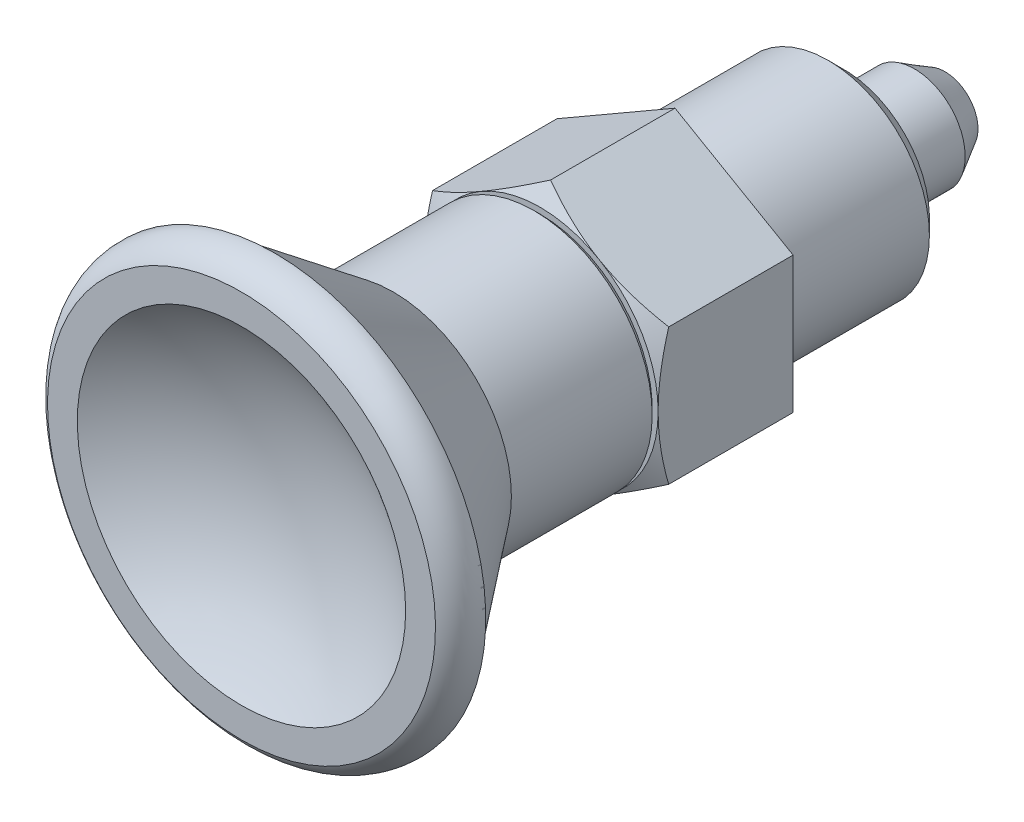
ISO-10303-21;
HEADER;
FILE_DESCRIPTION(('STEP AP214'),'2;1');
FILE_NAME('part.step','',(''),(''),'','','');
FILE_SCHEMA(('AUTOMOTIVE_DESIGN { 1 0 10303 214 1 1 1 1 }'));
ENDSEC;
DATA;
#1=APPLICATION_CONTEXT('core data for automotive mechanical design processes');
#2=APPLICATION_PROTOCOL_DEFINITION('international standard','automotive_design',2000,#1);
#3=PRODUCT_CONTEXT('',#1,'mechanical');
#4=PRODUCT('Part','Part','',(#3));
#5=PRODUCT_RELATED_PRODUCT_CATEGORY('part','',(#4));
#6=PRODUCT_DEFINITION_FORMATION('','',#4);
#7=PRODUCT_DEFINITION_CONTEXT('part definition',#1,'design');
#8=PRODUCT_DEFINITION('design','',#6,#7);
#9=PRODUCT_DEFINITION_SHAPE('','',#8);
#10=(LENGTH_UNIT() NAMED_UNIT(*) SI_UNIT(.MILLI.,.METRE.));
#11=(NAMED_UNIT(*) PLANE_ANGLE_UNIT() SI_UNIT($,.RADIAN.));
#12=(NAMED_UNIT(*) SI_UNIT($,.STERADIAN.) SOLID_ANGLE_UNIT());
#13=UNCERTAINTY_MEASURE_WITH_UNIT(LENGTH_MEASURE(1.E-05),#10,'distance_accuracy_value','');
#14=(GEOMETRIC_REPRESENTATION_CONTEXT(3) GLOBAL_UNCERTAINTY_ASSIGNED_CONTEXT((#13)) GLOBAL_UNIT_ASSIGNED_CONTEXT((#10,
#11,#12)) REPRESENTATION_CONTEXT('',''));
#15=CARTESIAN_POINT('',(0.,0.,0.));
#16=DIRECTION('',(0.,0.,1.));
#17=DIRECTION('',(1.,0.,0.));
#18=AXIS2_PLACEMENT_3D('',#15,#16,#17);
#19=CARTESIAN_POINT('',(0.,0.,6.8452994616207));
#20=DIRECTION('',(0.,0.,-1.));
#21=DIRECTION('',(0.,1.,0.));
#22=AXIS2_PLACEMENT_3D('',#19,#20,#21);
#23=CONICAL_SURFACE('',#22,9.,1.04719755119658);
#24=CARTESIAN_POINT('',(-7.0002,4.04133641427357,7.37471854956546));
#25=CARTESIAN_POINT('',(-6.84633209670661,4.13017208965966,7.42600015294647));
#26=CARTESIAN_POINT('',(-6.69189049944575,4.21933898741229,7.47495440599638));
#27=CARTESIAN_POINT('',(-6.38175307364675,4.39839691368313,7.56756721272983));
#28=CARTESIAN_POINT('',(-6.22605673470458,4.48828823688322,7.61122348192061));
#29=CARTESIAN_POINT('',(-5.75647483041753,4.75940147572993,7.73338840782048));
#30=CARTESIAN_POINT('',(-5.44073566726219,4.94169356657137,7.80287444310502));
#31=CARTESIAN_POINT('',(-4.96823775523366,5.21449036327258,7.88435504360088));
#32=CARTESIAN_POINT('',(-4.8128907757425,5.3041799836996,7.90756651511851));
#33=CARTESIAN_POINT('',(-4.50149488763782,5.48396448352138,7.94648878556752));
#34=CARTESIAN_POINT('',(-4.34544604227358,5.57405932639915,7.96220024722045));
#35=CARTESIAN_POINT('',(-4.03307732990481,5.75440548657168,7.98572208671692));
#36=CARTESIAN_POINT('',(-3.87675797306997,5.84465650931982,7.99354143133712));
#37=CARTESIAN_POINT('',(-3.5639834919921,6.02523694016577,8.00111975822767));
#38=CARTESIAN_POINT('',(-3.40752837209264,6.11556634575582,8.00087898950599));
#39=CARTESIAN_POINT('',(-2.97889312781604,6.36303901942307,7.98914026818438));
#40=CARTESIAN_POINT('',(-2.70685331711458,6.52010127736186,7.96943425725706));
#41=CARTESIAN_POINT('',(-2.16458055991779,6.83318259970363,7.9069465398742));
#42=CARTESIAN_POINT('',(-1.89434952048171,6.98920056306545,7.86414347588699));
#43=CARTESIAN_POINT('',(-1.35098545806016,7.3029119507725,7.7571483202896));
#44=CARTESIAN_POINT('',(-1.07792099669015,7.46056579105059,7.69250290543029));
#45=CARTESIAN_POINT('',(-0.535864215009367,7.77352241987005,7.54578392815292));
#46=CARTESIAN_POINT('',(-0.266864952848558,7.92882921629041,7.46374482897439));
#47=CARTESIAN_POINT('',(0.000200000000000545,8.08301923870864,7.37471854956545));
#48=B_SPLINE_CURVE_WITH_KNOTS('',3,(#24,#25,#26,#27,#28,#29,#30,#31,#32,#33,#34,#35,#36,#37,#38,
#39,#40,#41,#42,#43,#44,#45,#46,#47),.UNSPECIFIED.,.F.,.F.,(4,2,2,2,2,2,2,2,2,2,2,4),(0.,
0.554727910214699,1.1096941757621,2.22193274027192,2.76443041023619,3.3068801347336,
3.84871284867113,4.39052882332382,5.33376515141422,6.27787517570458,7.24292418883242,
8.20607866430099),.UNSPECIFIED.);
#49=CARTESIAN_POINT('',(-7.,4.0414518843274,7.37478521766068));
#50=VERTEX_POINT('',#49);
#51=CARTESIAN_POINT('',(-3.5,6.06217782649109,8.));
#52=VERTEX_POINT('',#51);
#53=EDGE_CURVE('E9',#50,#52,#48,.T.);
#54=ORIENTED_EDGE('',*,*,#53,.F.);
#55=CARTESIAN_POINT('',(-7.,10.7921411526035,4.61469147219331));
#56=CARTESIAN_POINT('',(-7.,10.4869372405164,4.7624854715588));
#57=CARTESIAN_POINT('',(-7.,10.1810258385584,4.90884381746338));
#58=CARTESIAN_POINT('',(-7.,9.56741155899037,5.19788046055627));
#59=CARTESIAN_POINT('',(-7.,9.25970840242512,5.34055816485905));
#60=CARTESIAN_POINT('',(-7.,8.64051790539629,5.62215630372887));
#61=CARTESIAN_POINT('',(-7.,8.32901904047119,5.76105148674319));
#62=CARTESIAN_POINT('',(-7.,7.703521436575,6.03307211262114));
#63=CARTESIAN_POINT('',(-7.,7.38952281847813,6.1661978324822));
#64=CARTESIAN_POINT('',(-7.,6.74863178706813,6.42921468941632));
#65=CARTESIAN_POINT('',(-7.,6.42164362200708,6.55887381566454));
#66=CARTESIAN_POINT('',(-7.,5.76381906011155,6.80822385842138));
#67=CARTESIAN_POINT('',(-7.,5.43298223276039,6.92791364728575));
#68=CARTESIAN_POINT('',(-7.,4.7675701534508,7.15413568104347));
#69=CARTESIAN_POINT('',(-7.,4.4330042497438,7.26069512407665));
#70=CARTESIAN_POINT('',(-7.,3.75908615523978,7.45719671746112));
#71=CARTESIAN_POINT('',(-7.,3.41973552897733,7.54714417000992));
#72=CARTESIAN_POINT('',(-7.,2.73787385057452,7.70558127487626));
#73=CARTESIAN_POINT('',(-7.,2.39539007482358,7.77418511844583));
#74=CARTESIAN_POINT('',(-7.,1.8785972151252,7.8580824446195));
#75=CARTESIAN_POINT('',(-7.,1.70580851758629,7.88288130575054));
#76=CARTESIAN_POINT('',(-7.,1.35939411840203,7.92565507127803));
#77=CARTESIAN_POINT('',(-7.,1.18576849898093,7.9436306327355));
#78=CARTESIAN_POINT('',(-7.,0.840152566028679,7.97217754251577));
#79=CARTESIAN_POINT('',(-7.,0.668169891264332,7.98284102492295));
#80=CARTESIAN_POINT('',(-7.,0.323907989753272,7.99689014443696));
#81=CARTESIAN_POINT('',(-7.,0.151628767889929,8.00027590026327));
#82=CARTESIAN_POINT('',(-7.,-0.192918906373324,7.99968894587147));
#83=CARTESIAN_POINT('',(-7.,-0.365187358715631,7.99571619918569));
#84=CARTESIAN_POINT('',(-7.,-0.709405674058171,7.98050822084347));
#85=CARTESIAN_POINT('',(-7.,-0.881355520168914,7.96927261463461));
#86=CARTESIAN_POINT('',(-7.,-1.29656419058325,7.93360844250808));
#87=CARTESIAN_POINT('',(-7.,-1.53952391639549,7.90562508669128));
#88=CARTESIAN_POINT('',(-7.,-2.02358645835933,7.83670005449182));
#89=CARTESIAN_POINT('',(-7.,-2.26468900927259,7.79575656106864));
#90=CARTESIAN_POINT('',(-7.,-2.98496612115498,7.65566158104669));
#91=CARTESIAN_POINT('',(-7.,-3.46082937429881,7.53927285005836));
#92=CARTESIAN_POINT('',(-7.,-4.17226891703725,7.33812667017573));
#93=CARTESIAN_POINT('',(-7.,-4.41155271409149,7.26573394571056));
#94=CARTESIAN_POINT('',(-7.,-4.88779522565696,7.1135987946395));
#95=CARTESIAN_POINT('',(-7.,-5.12475392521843,7.03385632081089));
#96=CARTESIAN_POINT('',(-7.,-5.59642388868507,6.86828693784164));
#97=CARTESIAN_POINT('',(-7.,-5.83113590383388,6.78246214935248));
#98=CARTESIAN_POINT('',(-7.,-6.29862697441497,6.60572099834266));
#99=CARTESIAN_POINT('',(-7.,-6.53140604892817,6.51480468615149));
#100=CARTESIAN_POINT('',(-7.,-7.06557704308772,6.30051481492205));
#101=CARTESIAN_POINT('',(-7.,-7.36637278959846,6.17565822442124));
#102=CARTESIAN_POINT('',(-7.,-7.96552548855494,5.92020942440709));
#103=CARTESIAN_POINT('',(-7.,-8.2638823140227,5.7896169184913));
#104=CARTESIAN_POINT('',(-7.,-8.85859165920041,5.52380350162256));
#105=CARTESIAN_POINT('',(-7.,-9.154943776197,5.3885816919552));
#106=CARTESIAN_POINT('',(-7.,-9.74590757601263,5.11440821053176));
#107=CARTESIAN_POINT('',(-7.,-10.0405192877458,4.97545660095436));
#108=CARTESIAN_POINT('',(-7.,-10.628550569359,4.69436920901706));
#109=CARTESIAN_POINT('',(-7.,-10.9219687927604,4.55223061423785));
#110=CARTESIAN_POINT('',(-7.,-11.5075648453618,4.26541871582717));
#111=CARTESIAN_POINT('',(-7.,-11.7997426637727,4.12074539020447));
#112=CARTESIAN_POINT('',(-7.,-12.6747152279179,3.68356993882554));
#113=CARTESIAN_POINT('',(-7.,-13.255936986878,3.38791816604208));
#114=CARTESIAN_POINT('',(-7.,-14.1023633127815,2.95185409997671));
#115=CARTESIAN_POINT('',(-7.,-14.368788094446,2.81379549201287));
#116=CARTESIAN_POINT('',(-7.,-14.9010560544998,2.53657172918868));
#117=CARTESIAN_POINT('',(-7.,-15.1668992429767,2.39740659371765));
#118=CARTESIAN_POINT('',(-7.,-15.9636925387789,1.97846255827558));
#119=CARTESIAN_POINT('',(-7.,-16.4938863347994,1.69724538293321));
#120=CARTESIAN_POINT('',(-7.,-17.551488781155,1.13252083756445));
#121=CARTESIAN_POINT('',(-7.,-18.0789010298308,0.849020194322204));
#122=CARTESIAN_POINT('',(-7.,-19.1324378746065,0.279699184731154));
#123=CARTESIAN_POINT('',(-7.,-19.6585625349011,-0.00612106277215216));
#124=CARTESIAN_POINT('',(-7.,-20.1842086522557,-0.292813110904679));
#125=B_SPLINE_CURVE_WITH_KNOTS('',3,(#55,#56,#57,#58,#59,#60,#61,#62,#63,#64,#65,#66,#67,#68,
#69,#70,#71,#72,#73,#74,#75,#76,#77,#78,#79,#80,#81,#82,#83,#84,#85,#86,#87,#88,#89,#90,#91,#92,
#93,#94,#95,#96,#97,#98,#99,#100,#101,#102,#103,#104,#105,#106,#107,#108,#109,#110,#111,#112,
#113,#114,#115,#116,#117,#118,#119,#120,#121,#122,#123,#124),.UNSPECIFIED.,.F.,.F.,(4,2,2,2,2,2,
2,2,2,2,2,2,2,2,2,2,2,2,2,2,2,2,2,2,2,2,2,2,2,2,2,2,2,2,4),(0.,1.01732903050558,
2.03482092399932,3.05796063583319,4.08105117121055,5.13619506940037,6.19145815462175,
7.24449725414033,8.29719966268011,9.34416906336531,9.86773312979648,10.391246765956,
10.9080364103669,11.4248176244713,11.9416013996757,12.4584118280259,13.1916938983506,
13.9250788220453,15.3926911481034,16.1426154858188,16.8925446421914,17.6422136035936,
18.391875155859,19.3688356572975,20.3458467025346,21.3230485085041,22.3002340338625,
23.278318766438,24.2564119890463,26.2126387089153,27.1128495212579,28.0130445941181,
29.8135024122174,31.6098334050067,33.4060729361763),.UNSPECIFIED.);
#126=CARTESIAN_POINT('',(-7.,0.,8.));
#127=VERTEX_POINT('',#126);
#128=EDGE_CURVE('E164',#127,#50,#125,.F.);
#129=ORIENTED_EDGE('',*,*,#128,.F.);
#130=CARTESIAN_POINT('',(0.,0.,8.));
#131=DIRECTION('',(0.,0.,1.));
#132=DIRECTION('',(0.,-1.,0.));
#133=AXIS2_PLACEMENT_3D('',#130,#131,#132);
#134=CIRCLE('',#133,7.);
#135=EDGE_CURVE('E487',#52,#127,#134,.T.);
#136=ORIENTED_EDGE('',*,*,#135,.F.);
#137=EDGE_LOOP('',(#54,#129,#136));
#138=FACE_BOUND('',#137,.T.);
#139=ADVANCED_FACE('F14',(#138),#23,.T.);
#140=CARTESIAN_POINT('',(0.,8.0829037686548,7.37478521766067));
#141=VERTEX_POINT('',#140);
#142=EDGE_CURVE('E18',#52,#141,#48,.T.);
#143=ORIENTED_EDGE('',*,*,#142,.F.);
#144=CARTESIAN_POINT('',(3.5,6.06217782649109,8.));
#145=VERTEX_POINT('',#144);
#146=EDGE_CURVE('E481',#145,#52,#134,.T.);
#147=ORIENTED_EDGE('',*,*,#146,.F.);
#148=CARTESIAN_POINT('',(-0.000200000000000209,8.08301923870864,7.37471854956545));
#149=CARTESIAN_POINT('',(0.153667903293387,7.99418356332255,7.42600015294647));
#150=CARTESIAN_POINT('',(0.308109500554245,7.90501666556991,7.47495440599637));
#151=CARTESIAN_POINT('',(0.61824692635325,7.72595873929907,7.56756721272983));
#152=CARTESIAN_POINT('',(0.773943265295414,7.63606741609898,7.61122348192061));
#153=CARTESIAN_POINT('',(1.24352516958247,7.36495417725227,7.73338840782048));
#154=CARTESIAN_POINT('',(1.55926433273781,7.18266208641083,7.80287444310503));
#155=CARTESIAN_POINT('',(2.03176224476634,6.90986528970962,7.88435504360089));
#156=CARTESIAN_POINT('',(2.1871092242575,6.8201756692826,7.90756651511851));
#157=CARTESIAN_POINT('',(2.49850511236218,6.64039116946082,7.94648878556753));
#158=CARTESIAN_POINT('',(2.65455395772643,6.55029632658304,7.96220024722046));
#159=CARTESIAN_POINT('',(2.9669226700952,6.36995016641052,7.98572208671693));
#160=CARTESIAN_POINT('',(3.12324202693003,6.27969914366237,7.99354143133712));
#161=CARTESIAN_POINT('',(3.43601650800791,6.09911871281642,8.00111975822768));
#162=CARTESIAN_POINT('',(3.59247162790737,6.00878930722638,8.000878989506));
#163=CARTESIAN_POINT('',(4.02110687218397,5.76131663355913,7.98914026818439));
#164=CARTESIAN_POINT('',(4.29314668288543,5.60425437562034,7.96943425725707));
#165=CARTESIAN_POINT('',(4.83541944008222,5.29117305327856,7.90694653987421));
#166=CARTESIAN_POINT('',(5.1056504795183,5.13515508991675,7.864143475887));
#167=CARTESIAN_POINT('',(5.64901454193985,4.8214437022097,7.75714832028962));
#168=CARTESIAN_POINT('',(5.92207900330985,4.66378986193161,7.69250290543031));
#169=CARTESIAN_POINT('',(6.46413578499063,4.35083323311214,7.54578392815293));
#170=CARTESIAN_POINT('',(6.73313504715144,4.19552643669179,7.4637448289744));
#171=CARTESIAN_POINT('',(7.0002,4.04133641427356,7.37471854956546));
#172=B_SPLINE_CURVE_WITH_KNOTS('',3,(#148,#149,#150,#151,#152,#153,#154,#155,#156,#157,#158,
#159,#160,#161,#162,#163,#164,#165,#166,#167,#168,#169,#170,#171),.UNSPECIFIED.,.F.,.F.,(4,2,2,
2,2,2,2,2,2,2,2,4),(0.,0.554727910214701,1.1096941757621,2.22193274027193,2.76443041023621,
3.30688013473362,3.84871284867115,4.39052882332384,5.33376515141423,6.2778751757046,
7.24292418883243,8.206078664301),.UNSPECIFIED.);
#173=EDGE_CURVE('E211',#141,#145,#172,.T.);
#174=ORIENTED_EDGE('',*,*,#173,.F.);
#175=EDGE_LOOP('',(#143,#147,#174));
#176=FACE_BOUND('',#175,.T.);
#177=ADVANCED_FACE('F181',(#176),#23,.T.);
#178=CARTESIAN_POINT('',(7.,4.0414518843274,7.37478521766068));
#179=VERTEX_POINT('',#178);
#180=EDGE_CURVE('E205',#145,#179,#172,.T.);
#181=ORIENTED_EDGE('',*,*,#180,.F.);
#182=CARTESIAN_POINT('',(7.,0.,8.));
#183=VERTEX_POINT('',#182);
#184=EDGE_CURVE('E125',#183,#145,#134,.T.);
#185=ORIENTED_EDGE('',*,*,#184,.F.);
#186=CARTESIAN_POINT('',(7.,10.7921411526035,4.61469147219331));
#187=CARTESIAN_POINT('',(7.,10.4869372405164,4.7624854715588));
#188=CARTESIAN_POINT('',(7.,10.1810258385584,4.90884381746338));
#189=CARTESIAN_POINT('',(7.,9.56741155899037,5.19788046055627));
#190=CARTESIAN_POINT('',(7.,9.25970840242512,5.34055816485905));
#191=CARTESIAN_POINT('',(7.,8.64051790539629,5.62215630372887));
#192=CARTESIAN_POINT('',(7.,8.32901904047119,5.76105148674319));
#193=CARTESIAN_POINT('',(7.,7.703521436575,6.03307211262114));
#194=CARTESIAN_POINT('',(7.,7.38952281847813,6.1661978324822));
#195=CARTESIAN_POINT('',(7.,6.74863178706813,6.42921468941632));
#196=CARTESIAN_POINT('',(7.,6.42164362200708,6.55887381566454));
#197=CARTESIAN_POINT('',(7.,5.76381906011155,6.80822385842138));
#198=CARTESIAN_POINT('',(7.,5.43298223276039,6.92791364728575));
#199=CARTESIAN_POINT('',(7.,4.7675701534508,7.15413568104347));
#200=CARTESIAN_POINT('',(7.,4.4330042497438,7.26069512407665));
#201=CARTESIAN_POINT('',(7.,3.75908615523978,7.45719671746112));
#202=CARTESIAN_POINT('',(7.,3.41973552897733,7.54714417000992));
#203=CARTESIAN_POINT('',(7.,2.73787385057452,7.70558127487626));
#204=CARTESIAN_POINT('',(7.,2.39539007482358,7.77418511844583));
#205=CARTESIAN_POINT('',(7.,1.8785972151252,7.8580824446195));
#206=CARTESIAN_POINT('',(7.,1.70580851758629,7.88288130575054));
#207=CARTESIAN_POINT('',(7.,1.35939411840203,7.92565507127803));
#208=CARTESIAN_POINT('',(7.,1.18576849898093,7.9436306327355));
#209=CARTESIAN_POINT('',(7.,0.840152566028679,7.97217754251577));
#210=CARTESIAN_POINT('',(7.,0.668169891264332,7.98284102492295));
#211=CARTESIAN_POINT('',(7.,0.323907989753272,7.99689014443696));
#212=CARTESIAN_POINT('',(7.,0.151628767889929,8.00027590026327));
#213=CARTESIAN_POINT('',(7.,-0.192918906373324,7.99968894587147));
#214=CARTESIAN_POINT('',(7.,-0.365187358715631,7.99571619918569));
#215=CARTESIAN_POINT('',(7.,-0.709405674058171,7.98050822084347));
#216=CARTESIAN_POINT('',(7.,-0.881355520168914,7.96927261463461));
#217=CARTESIAN_POINT('',(7.,-1.29656419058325,7.93360844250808));
#218=CARTESIAN_POINT('',(7.,-1.53952391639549,7.90562508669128));
#219=CARTESIAN_POINT('',(7.,-2.02358645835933,7.83670005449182));
#220=CARTESIAN_POINT('',(7.,-2.26468900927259,7.79575656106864));
#221=CARTESIAN_POINT('',(7.,-2.98496612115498,7.65566158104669));
#222=CARTESIAN_POINT('',(7.,-3.46082937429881,7.53927285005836));
#223=CARTESIAN_POINT('',(7.,-4.17226891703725,7.33812667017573));
#224=CARTESIAN_POINT('',(7.,-4.41155271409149,7.26573394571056));
#225=CARTESIAN_POINT('',(7.,-4.88779522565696,7.1135987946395));
#226=CARTESIAN_POINT('',(7.,-5.12475392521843,7.03385632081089));
#227=CARTESIAN_POINT('',(7.,-5.59642388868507,6.86828693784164));
#228=CARTESIAN_POINT('',(7.,-5.83113590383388,6.78246214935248));
#229=CARTESIAN_POINT('',(7.,-6.29862697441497,6.60572099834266));
#230=CARTESIAN_POINT('',(7.,-6.53140604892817,6.51480468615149));
#231=CARTESIAN_POINT('',(7.,-7.06557704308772,6.30051481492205));
#232=CARTESIAN_POINT('',(7.,-7.36637278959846,6.17565822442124));
#233=CARTESIAN_POINT('',(7.,-7.96552548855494,5.92020942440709));
#234=CARTESIAN_POINT('',(7.,-8.2638823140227,5.7896169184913));
#235=CARTESIAN_POINT('',(7.,-8.85859165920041,5.52380350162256));
#236=CARTESIAN_POINT('',(7.,-9.154943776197,5.3885816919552));
#237=CARTESIAN_POINT('',(7.,-9.74590757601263,5.11440821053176));
#238=CARTESIAN_POINT('',(7.,-10.0405192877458,4.97545660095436));
#239=CARTESIAN_POINT('',(7.,-10.628550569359,4.69436920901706));
#240=CARTESIAN_POINT('',(7.,-10.9219687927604,4.55223061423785));
#241=CARTESIAN_POINT('',(7.,-11.5075648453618,4.26541871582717));
#242=CARTESIAN_POINT('',(7.,-11.7997426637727,4.12074539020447));
#243=CARTESIAN_POINT('',(7.,-12.6747152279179,3.68356993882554));
#244=CARTESIAN_POINT('',(7.,-13.255936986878,3.38791816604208));
#245=CARTESIAN_POINT('',(7.,-14.1023633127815,2.95185409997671));
#246=CARTESIAN_POINT('',(7.,-14.368788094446,2.81379549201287));
#247=CARTESIAN_POINT('',(7.,-14.9010560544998,2.53657172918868));
#248=CARTESIAN_POINT('',(7.,-15.1668992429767,2.39740659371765));
#249=CARTESIAN_POINT('',(7.,-15.9636925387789,1.97846255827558));
#250=CARTESIAN_POINT('',(7.,-16.4938863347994,1.69724538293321));
#251=CARTESIAN_POINT('',(7.,-17.551488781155,1.13252083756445));
#252=CARTESIAN_POINT('',(7.,-18.0789010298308,0.849020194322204));
#253=CARTESIAN_POINT('',(7.,-19.1324378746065,0.279699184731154));
#254=CARTESIAN_POINT('',(7.,-19.6585625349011,-0.00612106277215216));
#255=CARTESIAN_POINT('',(7.,-20.1842086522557,-0.292813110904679));
#256=B_SPLINE_CURVE_WITH_KNOTS('',3,(#186,#187,#188,#189,#190,#191,#192,#193,#194,#195,#196,
#197,#198,#199,#200,#201,#202,#203,#204,#205,#206,#207,#208,#209,#210,#211,#212,#213,#214,#215,
#216,#217,#218,#219,#220,#221,#222,#223,#224,#225,#226,#227,#228,#229,#230,#231,#232,#233,#234,
#235,#236,#237,#238,#239,#240,#241,#242,#243,#244,#245,#246,#247,#248,#249,#250,#251,#252,#253,
#254,#255),.UNSPECIFIED.,.F.,.F.,(4,2,2,2,2,2,2,2,2,2,2,2,2,2,2,2,2,2,2,2,2,2,2,2,2,2,2,2,2,2,2,
2,2,2,4),(0.,1.01732903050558,2.03482092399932,3.05796063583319,4.08105117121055,
5.13619506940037,6.19145815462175,7.24449725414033,8.29719966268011,9.34416906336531,
9.86773312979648,10.391246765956,10.9080364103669,11.4248176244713,11.9416013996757,
12.4584118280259,13.1916938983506,13.9250788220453,15.3926911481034,16.1426154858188,
16.8925446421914,17.6422136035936,18.391875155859,19.3688356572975,20.3458467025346,
21.3230485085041,22.3002340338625,23.278318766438,24.2564119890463,26.2126387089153,
27.1128495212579,28.0130445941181,29.8135024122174,31.6098334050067,33.4060729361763),.UNSPECIFIED.);
#257=EDGE_CURVE('E212',#179,#183,#256,.T.);
#258=ORIENTED_EDGE('',*,*,#257,.F.);
#259=EDGE_LOOP('',(#181,#185,#258));
#260=FACE_BOUND('',#259,.T.);
#261=ADVANCED_FACE('F359',(#260),#23,.T.);
#262=CARTESIAN_POINT('',(7.,-4.0414518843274,7.37478521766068));
#263=VERTEX_POINT('',#262);
#264=EDGE_CURVE('E199',#183,#263,#256,.T.);
#265=ORIENTED_EDGE('',*,*,#264,.F.);
#266=CARTESIAN_POINT('',(3.5,-6.06217782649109,8.));
#267=VERTEX_POINT('',#266);
#268=EDGE_CURVE('E121',#267,#183,#134,.T.);
#269=ORIENTED_EDGE('',*,*,#268,.F.);
#270=CARTESIAN_POINT('',(7.0002,-4.04133641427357,7.37471854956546));
#271=CARTESIAN_POINT('',(6.84633209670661,-4.13017208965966,7.42600015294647));
#272=CARTESIAN_POINT('',(6.69189049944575,-4.21933898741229,7.47495440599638));
#273=CARTESIAN_POINT('',(6.38175307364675,-4.39839691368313,7.56756721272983));
#274=CARTESIAN_POINT('',(6.22605673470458,-4.48828823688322,7.61122348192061));
#275=CARTESIAN_POINT('',(5.75647483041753,-4.75940147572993,7.73338840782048));
#276=CARTESIAN_POINT('',(5.44073566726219,-4.94169356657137,7.80287444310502));
#277=CARTESIAN_POINT('',(4.96823775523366,-5.21449036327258,7.88435504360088));
#278=CARTESIAN_POINT('',(4.8128907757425,-5.3041799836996,7.90756651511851));
#279=CARTESIAN_POINT('',(4.50149488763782,-5.48396448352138,7.94648878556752));
#280=CARTESIAN_POINT('',(4.34544604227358,-5.57405932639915,7.96220024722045));
#281=CARTESIAN_POINT('',(4.03307732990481,-5.75440548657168,7.98572208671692));
#282=CARTESIAN_POINT('',(3.87675797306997,-5.84465650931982,7.99354143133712));
#283=CARTESIAN_POINT('',(3.5639834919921,-6.02523694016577,8.00111975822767));
#284=CARTESIAN_POINT('',(3.40752837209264,-6.11556634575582,8.00087898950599));
#285=CARTESIAN_POINT('',(2.97889312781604,-6.36303901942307,7.98914026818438));
#286=CARTESIAN_POINT('',(2.70685331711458,-6.52010127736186,7.96943425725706));
#287=CARTESIAN_POINT('',(2.16458055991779,-6.83318259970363,7.9069465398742));
#288=CARTESIAN_POINT('',(1.89434952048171,-6.98920056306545,7.86414347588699));
#289=CARTESIAN_POINT('',(1.35098545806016,-7.3029119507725,7.7571483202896));
#290=CARTESIAN_POINT('',(1.07792099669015,-7.46056579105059,7.69250290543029));
#291=CARTESIAN_POINT('',(0.535864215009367,-7.77352241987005,7.54578392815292));
#292=CARTESIAN_POINT('',(0.266864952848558,-7.92882921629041,7.46374482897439));
#293=CARTESIAN_POINT('',(-0.000200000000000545,-8.08301923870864,7.37471854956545));
#294=B_SPLINE_CURVE_WITH_KNOTS('',3,(#270,#271,#272,#273,#274,#275,#276,#277,#278,#279,#280,
#281,#282,#283,#284,#285,#286,#287,#288,#289,#290,#291,#292,#293),.UNSPECIFIED.,.F.,.F.,(4,2,2,
2,2,2,2,2,2,2,2,4),(0.,0.554727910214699,1.1096941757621,2.22193274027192,2.76443041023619,
3.3068801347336,3.84871284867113,4.39052882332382,5.33376515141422,6.27787517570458,
7.24292418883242,8.20607866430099),.UNSPECIFIED.);
#295=EDGE_CURVE('E513',#263,#267,#294,.T.);
#296=ORIENTED_EDGE('',*,*,#295,.F.);
#297=EDGE_LOOP('',(#265,#269,#296));
#298=FACE_BOUND('',#297,.T.);
#299=ADVANCED_FACE('F350',(#298),#23,.T.);
#300=CARTESIAN_POINT('',(0.,-8.0829037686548,7.37478521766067));
#301=VERTEX_POINT('',#300);
#302=EDGE_CURVE('E192',#267,#301,#294,.T.);
#303=ORIENTED_EDGE('',*,*,#302,.F.);
#304=CARTESIAN_POINT('',(-3.5,-6.06217782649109,8.));
#305=VERTEX_POINT('',#304);
#306=EDGE_CURVE('E120',#305,#267,#134,.T.);
#307=ORIENTED_EDGE('',*,*,#306,.F.);
#308=CARTESIAN_POINT('',(0.000200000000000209,-8.08301923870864,7.37471854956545));
#309=CARTESIAN_POINT('',(-0.153667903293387,-7.99418356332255,7.42600015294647));
#310=CARTESIAN_POINT('',(-0.308109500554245,-7.90501666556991,7.47495440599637));
#311=CARTESIAN_POINT('',(-0.61824692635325,-7.72595873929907,7.56756721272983));
#312=CARTESIAN_POINT('',(-0.773943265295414,-7.63606741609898,7.61122348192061));
#313=CARTESIAN_POINT('',(-1.24352516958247,-7.36495417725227,7.73338840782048));
#314=CARTESIAN_POINT('',(-1.55926433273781,-7.18266208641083,7.80287444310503));
#315=CARTESIAN_POINT('',(-2.03176224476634,-6.90986528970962,7.88435504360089));
#316=CARTESIAN_POINT('',(-2.1871092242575,-6.8201756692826,7.90756651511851));
#317=CARTESIAN_POINT('',(-2.49850511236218,-6.64039116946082,7.94648878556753));
#318=CARTESIAN_POINT('',(-2.65455395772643,-6.55029632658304,7.96220024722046));
#319=CARTESIAN_POINT('',(-2.9669226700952,-6.36995016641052,7.98572208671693));
#320=CARTESIAN_POINT('',(-3.12324202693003,-6.27969914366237,7.99354143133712));
#321=CARTESIAN_POINT('',(-3.43601650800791,-6.09911871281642,8.00111975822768));
#322=CARTESIAN_POINT('',(-3.59247162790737,-6.00878930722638,8.000878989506));
#323=CARTESIAN_POINT('',(-4.02110687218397,-5.76131663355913,7.98914026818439));
#324=CARTESIAN_POINT('',(-4.29314668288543,-5.60425437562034,7.96943425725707));
#325=CARTESIAN_POINT('',(-4.83541944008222,-5.29117305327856,7.90694653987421));
#326=CARTESIAN_POINT('',(-5.1056504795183,-5.13515508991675,7.864143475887));
#327=CARTESIAN_POINT('',(-5.64901454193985,-4.8214437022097,7.75714832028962));
#328=CARTESIAN_POINT('',(-5.92207900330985,-4.66378986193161,7.69250290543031));
#329=CARTESIAN_POINT('',(-6.46413578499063,-4.35083323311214,7.54578392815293));
#330=CARTESIAN_POINT('',(-6.73313504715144,-4.19552643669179,7.4637448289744));
#331=CARTESIAN_POINT('',(-7.0002,-4.04133641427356,7.37471854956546));
#332=B_SPLINE_CURVE_WITH_KNOTS('',3,(#308,#309,#310,#311,#312,#313,#314,#315,#316,#317,#318,
#319,#320,#321,#322,#323,#324,#325,#326,#327,#328,#329,#330,#331),.UNSPECIFIED.,.F.,.F.,(4,2,2,
2,2,2,2,2,2,2,2,4),(0.,0.554727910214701,1.1096941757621,2.22193274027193,2.76443041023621,
3.30688013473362,3.84871284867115,4.39052882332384,5.33376515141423,6.2778751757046,
7.24292418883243,8.206078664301),.UNSPECIFIED.);
#333=EDGE_CURVE('E510',#301,#305,#332,.T.);
#334=ORIENTED_EDGE('',*,*,#333,.F.);
#335=EDGE_LOOP('',(#303,#307,#334));
#336=FACE_BOUND('',#335,.T.);
#337=ADVANCED_FACE('F341',(#336),#23,.T.);
#338=CARTESIAN_POINT('',(-7.,-4.0414518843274,7.37478521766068));
#339=VERTEX_POINT('',#338);
#340=EDGE_CURVE('E103',#305,#339,#332,.T.);
#341=ORIENTED_EDGE('',*,*,#340,.F.);
#342=EDGE_CURVE('E490',#127,#305,#134,.T.);
#343=ORIENTED_EDGE('',*,*,#342,.F.);
#344=EDGE_CURVE('E41',#339,#127,#125,.F.);
#345=ORIENTED_EDGE('',*,*,#344,.F.);
#346=EDGE_LOOP('',(#341,#343,#345));
#347=FACE_BOUND('',#346,.T.);
#348=ADVANCED_FACE('F183',(#347),#23,.T.);
#349=CARTESIAN_POINT('',(2.10335221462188E-12,0.,38.3999999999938));
#350=DIRECTION('',(0.,0.,1.));
#351=DIRECTION('',(1.,0.,0.));
#352=AXIS2_PLACEMENT_3D('',#349,#350,#351);
#353=SPHERICAL_SURFACE('',#352,15.9999999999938);
#354=CARTESIAN_POINT('',(0.,0.,25.7));
#355=DIRECTION('',(0.,0.,1.));
#356=DIRECTION('',(0.,-1.,0.));
#357=AXIS2_PLACEMENT_3D('',#354,#355,#356);
#358=CIRCLE('',#357,9.7319062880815);
#359=CARTESIAN_POINT('',(0.,-9.7319062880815,25.7));
#360=VERTEX_POINT('',#359);
#361=EDGE_CURVE('E137',#360,#360,#358,.T.);
#362=ORIENTED_EDGE('',*,*,#361,.T.);
#363=EDGE_LOOP('',(#362));
#364=FACE_BOUND('',#363,.T.);
#365=ADVANCED_FACE('F16',(#364),#353,.F.);
#366=CARTESIAN_POINT('',(0.,0.,8.));
#367=DIRECTION('',(0.,0.,1.));
#368=DIRECTION('',(0.,-1.,0.));
#369=AXIS2_PLACEMENT_3D('',#366,#367,#368);
#370=CONICAL_SURFACE('',#369,6.6464466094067,0.785398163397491);
#371=CARTESIAN_POINT('',(0.,0.,8.35355339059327));
#372=DIRECTION('',(0.,0.,1.));
#373=DIRECTION('',(0.,-1.,0.));
#374=AXIS2_PLACEMENT_3D('',#371,#372,#373);
#375=CIRCLE('',#374,7.);
#376=CARTESIAN_POINT('',(0.,-7.,8.35355339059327));
#377=VERTEX_POINT('',#376);
#378=EDGE_CURVE('E152',#377,#377,#375,.T.);
#379=ORIENTED_EDGE('',*,*,#378,.F.);
#380=EDGE_LOOP('',(#379));
#381=FACE_BOUND('',#380,.T.);
#382=CARTESIAN_POINT('',(0.,0.,8.));
#383=DIRECTION('',(0.,0.,-1.));
#384=DIRECTION('',(0.,1.,0.));
#385=AXIS2_PLACEMENT_3D('',#382,#383,#384);
#386=CIRCLE('',#385,6.6464466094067);
#387=CARTESIAN_POINT('',(0.,6.6464466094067,8.));
#388=VERTEX_POINT('',#387);
#389=EDGE_CURVE('E134',#388,#388,#386,.T.);
#390=ORIENTED_EDGE('',*,*,#389,.F.);
#391=EDGE_LOOP('',(#390));
#392=FACE_BOUND('',#391,.T.);
#393=ADVANCED_FACE('F252',(#381,#392),#370,.T.);
#394=CARTESIAN_POINT('',(0.,0.,-16.));
#395=DIRECTION('',(0.,0.,1.));
#396=DIRECTION('',(0.,-1.,0.));
#397=AXIS2_PLACEMENT_3D('',#394,#395,#396);
#398=CYLINDRICAL_SURFACE('',#397,7.);
#399=CARTESIAN_POINT('',(0.,0.,16.7));
#400=DIRECTION('',(0.,0.,1.));
#401=DIRECTION('',(0.,-1.,0.));
#402=AXIS2_PLACEMENT_3D('',#399,#400,#401);
#403=CIRCLE('',#402,7.);
#404=CARTESIAN_POINT('',(0.,-7.,16.7));
#405=VERTEX_POINT('',#404);
#406=EDGE_CURVE('E149',#405,#405,#403,.T.);
#407=ORIENTED_EDGE('',*,*,#406,.F.);
#408=EDGE_LOOP('',(#407));
#409=FACE_BOUND('',#408,.T.);
#410=ORIENTED_EDGE('',*,*,#378,.T.);
#411=EDGE_LOOP('',(#410));
#412=FACE_BOUND('',#411,.T.);
#413=ADVANCED_FACE('F255',(#409,#412),#398,.T.);
#414=CARTESIAN_POINT('',(0.,0.,16.7));
#415=DIRECTION('',(0.,0.,1.));
#416=DIRECTION('',(0.,-1.,0.));
#417=AXIS2_PLACEMENT_3D('',#414,#415,#416);
#418=CONICAL_SURFACE('',#417,7.,0.652753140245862);
#419=CARTESIAN_POINT('',(0.,0.,23.893701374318));
#420=DIRECTION('',(0.,0.,1.));
#421=DIRECTION('',(0.,-1.,0.));
#422=AXIS2_PLACEMENT_3D('',#419,#420,#421);
#423=CIRCLE('',#422,12.5);
#424=CARTESIAN_POINT('',(0.,-12.5,23.893701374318));
#425=VERTEX_POINT('',#424);
#426=EDGE_CURVE('E146',#425,#425,#423,.T.);
#427=ORIENTED_EDGE('',*,*,#426,.F.);
#428=EDGE_LOOP('',(#427));
#429=FACE_BOUND('',#428,.T.);
#430=ORIENTED_EDGE('',*,*,#406,.T.);
#431=EDGE_LOOP('',(#430));
#432=FACE_BOUND('',#431,.T.);
#433=ADVANCED_FACE('F259',(#429,#432),#418,.T.);
#434=CARTESIAN_POINT('',(0.,0.,-16.));
#435=DIRECTION('',(0.,0.,1.));
#436=DIRECTION('',(0.,-1.,0.));
#437=AXIS2_PLACEMENT_3D('',#434,#435,#436);
#438=CYLINDRICAL_SURFACE('',#437,12.5);
#439=CARTESIAN_POINT('',(0.,0.,23.719324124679));
#440=DIRECTION('',(0.,0.,1.));
#441=DIRECTION('',(0.,-1.,0.));
#442=AXIS2_PLACEMENT_3D('',#439,#440,#441);
#443=CIRCLE('',#442,12.5);
#444=CARTESIAN_POINT('',(0.,-12.5,23.719324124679));
#445=VERTEX_POINT('',#444);
#446=EDGE_CURVE('E143',#445,#445,#443,.T.);
#447=ORIENTED_EDGE('',*,*,#446,.F.);
#448=EDGE_LOOP('',(#447));
#449=FACE_BOUND('',#448,.T.);
#450=ORIENTED_EDGE('',*,*,#426,.T.);
#451=EDGE_LOOP('',(#450));
#452=FACE_BOUND('',#451,.T.);
#453=ADVANCED_FACE('F263',(#449,#452),#438,.F.);
#454=CARTESIAN_POINT('',(0.,0.,23.9596620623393));
#455=DIRECTION('',(0.,0.,1.));
#456=DIRECTION('',(0.,-1.,0.));
#457=AXIS2_PLACEMENT_3D('',#454,#455,#456);
#458=TOROIDAL_SURFACE('',#457,10.5144930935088,2.00000000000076);
#459=CARTESIAN_POINT('',(0.,0.,25.7));
#460=DIRECTION('',(0.,0.,1.));
#461=DIRECTION('',(0.,-1.,0.));
#462=AXIS2_PLACEMENT_3D('',#459,#460,#461);
#463=CIRCLE('',#462,11.5);
#464=CARTESIAN_POINT('',(0.,-11.5,25.7));
#465=VERTEX_POINT('',#464);
#466=EDGE_CURVE('E140',#465,#465,#463,.T.);
#467=ORIENTED_EDGE('',*,*,#466,.F.);
#468=EDGE_LOOP('',(#467));
#469=FACE_BOUND('',#468,.T.);
#470=ORIENTED_EDGE('',*,*,#446,.T.);
#471=EDGE_LOOP('',(#470));
#472=FACE_BOUND('',#471,.T.);
#473=ADVANCED_FACE('F267',(#469,#472),#458,.T.);
#474=CARTESIAN_POINT('',(9.7319062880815,0.,25.7));
#475=DIRECTION('',(0.,0.,-1.));
#476=DIRECTION('',(0.,1.,0.));
#477=AXIS2_PLACEMENT_3D('',#474,#475,#476);
#478=PLANE('',#477);
#479=ORIENTED_EDGE('',*,*,#361,.F.);
#480=EDGE_LOOP('',(#479));
#481=FACE_BOUND('',#480,.T.);
#482=ORIENTED_EDGE('',*,*,#466,.T.);
#483=EDGE_LOOP('',(#482));
#484=FACE_BOUND('',#483,.T.);
#485=ADVANCED_FACE('F271',(#481,#484),#478,.F.);
#486=CARTESIAN_POINT('',(7.,0.,8.));
#487=DIRECTION('',(0.,0.,-1.));
#488=DIRECTION('',(0.,1.,0.));
#489=AXIS2_PLACEMENT_3D('',#486,#487,#488);
#490=PLANE('',#489);
#491=ORIENTED_EDGE('',*,*,#268,.T.);
#492=ORIENTED_EDGE('',*,*,#184,.T.);
#493=ORIENTED_EDGE('',*,*,#146,.T.);
#494=ORIENTED_EDGE('',*,*,#135,.T.);
#495=ORIENTED_EDGE('',*,*,#342,.T.);
#496=ORIENTED_EDGE('',*,*,#306,.T.);
#497=EDGE_LOOP('',(#491,#492,#493,#494,#495,#496));
#498=FACE_BOUND('',#497,.T.);
#499=ORIENTED_EDGE('',*,*,#389,.T.);
#500=EDGE_LOOP('',(#499));
#501=FACE_BOUND('',#500,.T.);
#502=ADVANCED_FACE('F275',(#498,#501),#490,.F.);
#503=CARTESIAN_POINT('',(0.,8.0829037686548,-2.));
#504=DIRECTION('',(-0.5,0.866025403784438,0.));
#505=DIRECTION('',(-0.866025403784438,-0.5,0.));
#506=AXIS2_PLACEMENT_3D('',#503,#504,#505);
#507=PLANE('',#506);
#508=DIRECTION('',(-0.866025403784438,-0.5,0.));
#509=VECTOR('',#508,1.);
#510=CARTESIAN_POINT('',(0.999999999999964,8.66025403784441,0.));
#511=LINE('',#510,#509);
#512=CARTESIAN_POINT('',(0.,8.0829037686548,0.));
#513=VERTEX_POINT('',#512);
#514=CARTESIAN_POINT('',(-7.,4.0414518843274,0.));
#515=VERTEX_POINT('',#514);
#516=EDGE_CURVE('E118',#513,#515,#511,.T.);
#517=ORIENTED_EDGE('',*,*,#516,.T.);
#518=DIRECTION('',(0.,0.,1.));
#519=VECTOR('',#518,1.);
#520=CARTESIAN_POINT('',(-7.,4.0414518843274,-2.));
#521=LINE('',#520,#519);
#522=EDGE_CURVE('E35',#515,#50,#521,.T.);
#523=ORIENTED_EDGE('',*,*,#522,.T.);
#524=ORIENTED_EDGE('',*,*,#53,.T.);
#525=ORIENTED_EDGE('',*,*,#142,.T.);
#526=DIRECTION('',(0.,0.,1.));
#527=VECTOR('',#526,1.);
#528=CARTESIAN_POINT('',(0.,8.0829037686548,-2.));
#529=LINE('',#528,#527);
#530=EDGE_CURVE('E96',#513,#141,#529,.T.);
#531=ORIENTED_EDGE('',*,*,#530,.F.);
#532=EDGE_LOOP('',(#517,#523,#524,#525,#531));
#533=FACE_BOUND('',#532,.T.);
#534=ADVANCED_FACE('F184',(#533),#507,.T.);
#535=CARTESIAN_POINT('',(7.,4.0414518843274,-2.));
#536=DIRECTION('',(0.5,0.866025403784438,0.));
#537=DIRECTION('',(-0.866025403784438,0.5,0.));
#538=AXIS2_PLACEMENT_3D('',#535,#536,#537);
#539=PLANE('',#538);
#540=DIRECTION('',(-0.866025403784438,0.5,0.));
#541=VECTOR('',#540,1.);
#542=CARTESIAN_POINT('',(8.,3.46410161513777,0.));
#543=LINE('',#542,#541);
#544=CARTESIAN_POINT('',(7.,4.0414518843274,0.));
#545=VERTEX_POINT('',#544);
#546=EDGE_CURVE('E116',#545,#513,#543,.T.);
#547=ORIENTED_EDGE('',*,*,#546,.T.);
#548=ORIENTED_EDGE('',*,*,#530,.T.);
#549=ORIENTED_EDGE('',*,*,#173,.T.);
#550=ORIENTED_EDGE('',*,*,#180,.T.);
#551=DIRECTION('',(0.,0.,1.));
#552=VECTOR('',#551,1.);
#553=CARTESIAN_POINT('',(7.,4.0414518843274,-2.));
#554=LINE('',#553,#552);
#555=EDGE_CURVE('E499',#545,#179,#554,.T.);
#556=ORIENTED_EDGE('',*,*,#555,.F.);
#557=EDGE_LOOP('',(#547,#548,#549,#550,#556));
#558=FACE_BOUND('',#557,.T.);
#559=ADVANCED_FACE('F213',(#558),#539,.T.);
#560=CARTESIAN_POINT('',(7.,-4.0414518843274,-2.));
#561=DIRECTION('',(1.,0.,0.));
#562=DIRECTION('',(0.,1.,0.));
#563=AXIS2_PLACEMENT_3D('',#560,#561,#562);
#564=PLANE('',#563);
#565=DIRECTION('',(0.,1.,0.));
#566=VECTOR('',#565,1.);
#567=CARTESIAN_POINT('',(7.,0.,0.));
#568=LINE('',#567,#566);
#569=CARTESIAN_POINT('',(7.,-4.0414518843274,0.));
#570=VERTEX_POINT('',#569);
#571=EDGE_CURVE('E111',#570,#545,#568,.T.);
#572=ORIENTED_EDGE('',*,*,#571,.T.);
#573=ORIENTED_EDGE('',*,*,#555,.T.);
#574=ORIENTED_EDGE('',*,*,#257,.T.);
#575=ORIENTED_EDGE('',*,*,#264,.T.);
#576=DIRECTION('',(0.,0.,1.));
#577=VECTOR('',#576,1.);
#578=CARTESIAN_POINT('',(7.,-4.0414518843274,-2.));
#579=LINE('',#578,#577);
#580=EDGE_CURVE('E503',#570,#263,#579,.T.);
#581=ORIENTED_EDGE('',*,*,#580,.F.);
#582=EDGE_LOOP('',(#572,#573,#574,#575,#581));
#583=FACE_BOUND('',#582,.T.);
#584=ADVANCED_FACE('F216',(#583),#564,.T.);
#585=CARTESIAN_POINT('',(0.,-8.0829037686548,-2.));
#586=DIRECTION('',(0.5,-0.866025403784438,0.));
#587=DIRECTION('',(0.866025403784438,0.5,0.));
#588=AXIS2_PLACEMENT_3D('',#585,#586,#587);
#589=PLANE('',#588);
#590=DIRECTION('',(0.866025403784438,0.5,0.));
#591=VECTOR('',#590,1.);
#592=CARTESIAN_POINT('',(8.,-3.46410161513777,0.));
#593=LINE('',#592,#591);
#594=CARTESIAN_POINT('',(0.,-8.0829037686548,0.));
#595=VERTEX_POINT('',#594);
#596=EDGE_CURVE('E109',#595,#570,#593,.T.);
#597=ORIENTED_EDGE('',*,*,#596,.T.);
#598=ORIENTED_EDGE('',*,*,#580,.T.);
#599=ORIENTED_EDGE('',*,*,#295,.T.);
#600=ORIENTED_EDGE('',*,*,#302,.T.);
#601=DIRECTION('',(0.,0.,1.));
#602=VECTOR('',#601,1.);
#603=CARTESIAN_POINT('',(0.,-8.0829037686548,-2.));
#604=LINE('',#603,#602);
#605=EDGE_CURVE('E104',#595,#301,#604,.T.);
#606=ORIENTED_EDGE('',*,*,#605,.F.);
#607=EDGE_LOOP('',(#597,#598,#599,#600,#606));
#608=FACE_BOUND('',#607,.T.);
#609=ADVANCED_FACE('F220',(#608),#589,.T.);
#610=CARTESIAN_POINT('',(-7.,-4.0414518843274,-2.));
#611=DIRECTION('',(-0.5,-0.866025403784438,0.));
#612=DIRECTION('',(0.866025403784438,-0.5,0.));
#613=AXIS2_PLACEMENT_3D('',#610,#611,#612);
#614=PLANE('',#613);
#615=DIRECTION('',(0.866025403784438,-0.5,0.));
#616=VECTOR('',#615,1.);
#617=CARTESIAN_POINT('',(0.999999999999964,-8.66025403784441,0.));
#618=LINE('',#617,#616);
#619=CARTESIAN_POINT('',(-7.,-4.0414518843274,0.));
#620=VERTEX_POINT('',#619);
#621=EDGE_CURVE('E95',#620,#595,#618,.T.);
#622=ORIENTED_EDGE('',*,*,#621,.T.);
#623=ORIENTED_EDGE('',*,*,#605,.T.);
#624=ORIENTED_EDGE('',*,*,#333,.T.);
#625=ORIENTED_EDGE('',*,*,#340,.T.);
#626=DIRECTION('',(0.,0.,1.));
#627=VECTOR('',#626,1.);
#628=CARTESIAN_POINT('',(-7.,-4.0414518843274,-2.));
#629=LINE('',#628,#627);
#630=EDGE_CURVE('E91',#620,#339,#629,.T.);
#631=ORIENTED_EDGE('',*,*,#630,.F.);
#632=EDGE_LOOP('',(#622,#623,#624,#625,#631));
#633=FACE_BOUND('',#632,.T.);
#634=ADVANCED_FACE('F99',(#633),#614,.T.);
#635=CARTESIAN_POINT('',(-7.,4.0414518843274,-2.));
#636=DIRECTION('',(-1.,0.,0.));
#637=DIRECTION('',(0.,-1.,0.));
#638=AXIS2_PLACEMENT_3D('',#635,#636,#637);
#639=PLANE('',#638);
#640=DIRECTION('',(0.,-1.,0.));
#641=VECTOR('',#640,1.);
#642=CARTESIAN_POINT('',(-7.,0.,0.));
#643=LINE('',#642,#641);
#644=EDGE_CURVE('E88',#515,#620,#643,.T.);
#645=ORIENTED_EDGE('',*,*,#644,.T.);
#646=ORIENTED_EDGE('',*,*,#630,.T.);
#647=ORIENTED_EDGE('',*,*,#344,.T.);
#648=ORIENTED_EDGE('',*,*,#128,.T.);
#649=ORIENTED_EDGE('',*,*,#522,.F.);
#650=EDGE_LOOP('',(#645,#646,#647,#648,#649));
#651=FACE_BOUND('',#650,.T.);
#652=ADVANCED_FACE('F90',(#651),#639,.T.);
#653=CARTESIAN_POINT('',(1.9607695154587,0.,-16.));
#654=DIRECTION('',(0.,0.,1.));
#655=DIRECTION('',(0.,-1.,0.));
#656=AXIS2_PLACEMENT_3D('',#653,#654,#655);
#657=PLANE('',#656);
#658=CARTESIAN_POINT('',(0.,0.,-16.));
#659=DIRECTION('',(0.,0.,1.));
#660=DIRECTION('',(0.,-1.,0.));
#661=AXIS2_PLACEMENT_3D('',#658,#659,#660);
#662=CIRCLE('',#661,1.9607695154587);
#663=CARTESIAN_POINT('',(0.,-1.9607695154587,-16.));
#664=VERTEX_POINT('',#663);
#665=EDGE_CURVE('E158',#664,#664,#662,.T.);
#666=ORIENTED_EDGE('',*,*,#665,.F.);
#667=EDGE_LOOP('',(#666));
#668=FACE_BOUND('',#667,.T.);
#669=ADVANCED_FACE('F232',(#668),#657,.F.);
#670=CARTESIAN_POINT('',(0.,0.,-16.));
#671=DIRECTION('',(0.,0.,1.));
#672=DIRECTION('',(0.,-1.,0.));
#673=AXIS2_PLACEMENT_3D('',#670,#671,#672);
#674=CONICAL_SURFACE('',#673,1.9607695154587,0.523598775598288);
#675=CARTESIAN_POINT('',(0.,0.,-14.2));
#676=DIRECTION('',(0.,0.,1.));
#677=DIRECTION('',(0.,-1.,0.));
#678=AXIS2_PLACEMENT_3D('',#675,#676,#677);
#679=CIRCLE('',#678,3.);
#680=CARTESIAN_POINT('',(0.,-3.,-14.2));
#681=VERTEX_POINT('',#680);
#682=EDGE_CURVE('E155',#681,#681,#679,.T.);
#683=ORIENTED_EDGE('',*,*,#682,.F.);
#684=EDGE_LOOP('',(#683));
#685=FACE_BOUND('',#684,.T.);
#686=ORIENTED_EDGE('',*,*,#665,.T.);
#687=EDGE_LOOP('',(#686));
#688=FACE_BOUND('',#687,.T.);
#689=ADVANCED_FACE('F237',(#685,#688),#674,.T.);
#690=CARTESIAN_POINT('',(0.,0.,-16.));
#691=DIRECTION('',(0.,0.,1.));
#692=DIRECTION('',(0.,-1.,0.));
#693=AXIS2_PLACEMENT_3D('',#690,#691,#692);
#694=CYLINDRICAL_SURFACE('',#693,3.);
#695=ORIENTED_EDGE('',*,*,#682,.T.);
#696=EDGE_LOOP('',(#695));
#697=FACE_BOUND('',#696,.T.);
#698=CARTESIAN_POINT('',(0.,0.,-10.));
#699=DIRECTION('',(0.,0.,1.));
#700=DIRECTION('',(0.,-1.,0.));
#701=AXIS2_PLACEMENT_3D('',#698,#699,#700);
#702=CIRCLE('',#701,3.);
#703=CARTESIAN_POINT('',(0.,-3.,-10.));
#704=VERTEX_POINT('',#703);
#705=EDGE_CURVE('E161',#704,#704,#702,.T.);
#706=ORIENTED_EDGE('',*,*,#705,.F.);
#707=EDGE_LOOP('',(#706));
#708=FACE_BOUND('',#707,.T.);
#709=ADVANCED_FACE('F243',(#697,#708),#694,.T.);
#710=CARTESIAN_POINT('',(3.,0.,-10.));
#711=DIRECTION('',(0.,0.,1.));
#712=DIRECTION('',(0.,-1.,0.));
#713=AXIS2_PLACEMENT_3D('',#710,#711,#712);
#714=PLANE('',#713);
#715=CARTESIAN_POINT('',(0.,0.,-10.));
#716=DIRECTION('',(0.,0.,1.));
#717=DIRECTION('',(0.,-1.,0.));
#718=AXIS2_PLACEMENT_3D('',#715,#716,#717);
#719=CIRCLE('',#718,5.08);
#720=CARTESIAN_POINT('',(0.,-5.08,-10.));
#721=VERTEX_POINT('',#720);
#722=EDGE_CURVE('E131',#721,#721,#719,.T.);
#723=ORIENTED_EDGE('',*,*,#722,.F.);
#724=EDGE_LOOP('',(#723));
#725=FACE_BOUND('',#724,.T.);
#726=ORIENTED_EDGE('',*,*,#705,.T.);
#727=EDGE_LOOP('',(#726));
#728=FACE_BOUND('',#727,.T.);
#729=ADVANCED_FACE('F250',(#725,#728),#714,.F.);
#730=CARTESIAN_POINT('',(0.,0.,-10.));
#731=DIRECTION('',(0.,0.,1.));
#732=DIRECTION('',(0.,-1.,0.));
#733=AXIS2_PLACEMENT_3D('',#730,#731,#732);
#734=CONICAL_SURFACE('',#733,5.08,0.78539816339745);
#735=CARTESIAN_POINT('',(0.,0.,-9.08));
#736=DIRECTION('',(0.,0.,1.));
#737=DIRECTION('',(0.,-1.,0.));
#738=AXIS2_PLACEMENT_3D('',#735,#736,#737);
#739=CIRCLE('',#738,6.);
#740=CARTESIAN_POINT('',(0.,-6.,-9.08));
#741=VERTEX_POINT('',#740);
#742=EDGE_CURVE('E128',#741,#741,#739,.T.);
#743=ORIENTED_EDGE('',*,*,#742,.F.);
#744=EDGE_LOOP('',(#743));
#745=FACE_BOUND('',#744,.T.);
#746=ORIENTED_EDGE('',*,*,#722,.T.);
#747=EDGE_LOOP('',(#746));
#748=FACE_BOUND('',#747,.T.);
#749=ADVANCED_FACE('F282',(#745,#748),#734,.T.);
#750=CARTESIAN_POINT('',(0.,0.,-10.));
#751=DIRECTION('',(0.,0.,1.));
#752=DIRECTION('',(0.,-1.,0.));
#753=AXIS2_PLACEMENT_3D('',#750,#751,#752);
#754=CYLINDRICAL_SURFACE('',#753,6.);
#755=CARTESIAN_POINT('',(0.,0.,0.));
#756=DIRECTION('',(0.,0.,1.));
#757=DIRECTION('',(0.,-1.,0.));
#758=AXIS2_PLACEMENT_3D('',#755,#756,#757);
#759=CIRCLE('',#758,6.);
#760=CARTESIAN_POINT('',(0.,-6.,0.));
#761=VERTEX_POINT('',#760);
#762=EDGE_CURVE('E124',#761,#761,#759,.T.);
#763=ORIENTED_EDGE('',*,*,#762,.F.);
#764=EDGE_LOOP('',(#763));
#765=FACE_BOUND('',#764,.T.);
#766=ORIENTED_EDGE('',*,*,#742,.T.);
#767=EDGE_LOOP('',(#766));
#768=FACE_BOUND('',#767,.T.);
#769=ADVANCED_FACE('F285',(#765,#768),#754,.T.);
#770=CARTESIAN_POINT('',(6.,0.,0.));
#771=DIRECTION('',(0.,0.,1.));
#772=DIRECTION('',(0.,-1.,0.));
#773=AXIS2_PLACEMENT_3D('',#770,#771,#772);
#774=PLANE('',#773);
#775=ORIENTED_EDGE('',*,*,#762,.T.);
#776=EDGE_LOOP('',(#775));
#777=FACE_BOUND('',#776,.T.);
#778=ORIENTED_EDGE('',*,*,#516,.F.);
#779=ORIENTED_EDGE('',*,*,#546,.F.);
#780=ORIENTED_EDGE('',*,*,#571,.F.);
#781=ORIENTED_EDGE('',*,*,#596,.F.);
#782=ORIENTED_EDGE('',*,*,#621,.F.);
#783=ORIENTED_EDGE('',*,*,#644,.F.);
#784=EDGE_LOOP('',(#778,#779,#780,#781,#782,#783));
#785=FACE_BOUND('',#784,.T.);
#786=ADVANCED_FACE('F107',(#777,#785),#774,.F.);
#787=CLOSED_SHELL('',(#139,#177,#261,#299,#337,#348,#365,#393,#413,#433,#453,#473,#485,#502,
#534,#559,#584,#609,#634,#652,#669,#689,#709,#729,#749,#769,#786));
#788=MANIFOLD_SOLID_BREP('B1',#787);
#789=ADVANCED_BREP_SHAPE_REPRESENTATION('',(#18,#788),#14);
#790=SHAPE_DEFINITION_REPRESENTATION(#9,#789);
ENDSEC;
END-ISO-10303-21;
